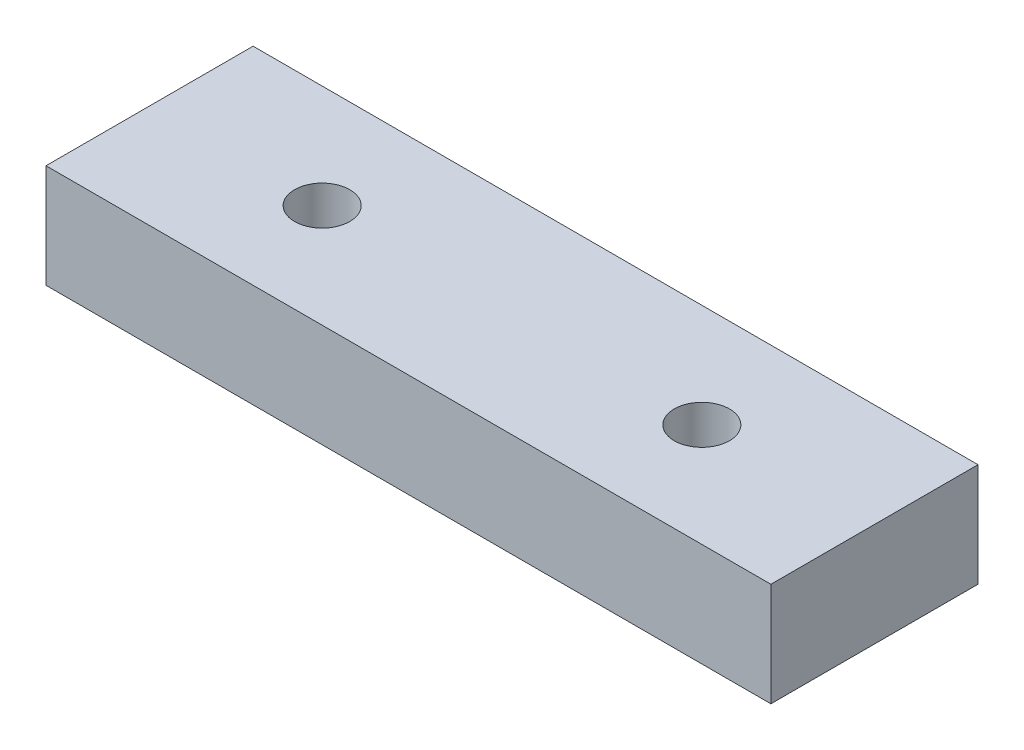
from build123d import *

# Parameters (mm, degrees)
SKETCH_1_W      = 42
SKETCH_1_H      = 12
SKETCH_1_R      = 1.6
EXTRUDE_1_DEPTH = 6


with BuildPart() as part:
    # Sketch 1 → Extrude 1 (new body)
    with BuildSketch(Plane(origin=(0, 0, 0), x_dir=(1, 0, 0), z_dir=(0, 1, 0))):
        with Locations((21, 6)):
            Rectangle(SKETCH_1_W, SKETCH_1_H)
        with Locations(Location((10, 6, 0), (0, 0, 270))):
            Circle(SKETCH_1_R, mode=Mode.SUBTRACT)
        with Locations(Location((32, 6, 0), (0, 0, 270))):
            Circle(SKETCH_1_R, mode=Mode.SUBTRACT)
    extrude(amount=EXTRUDE_1_DEPTH)


solid = part.part
